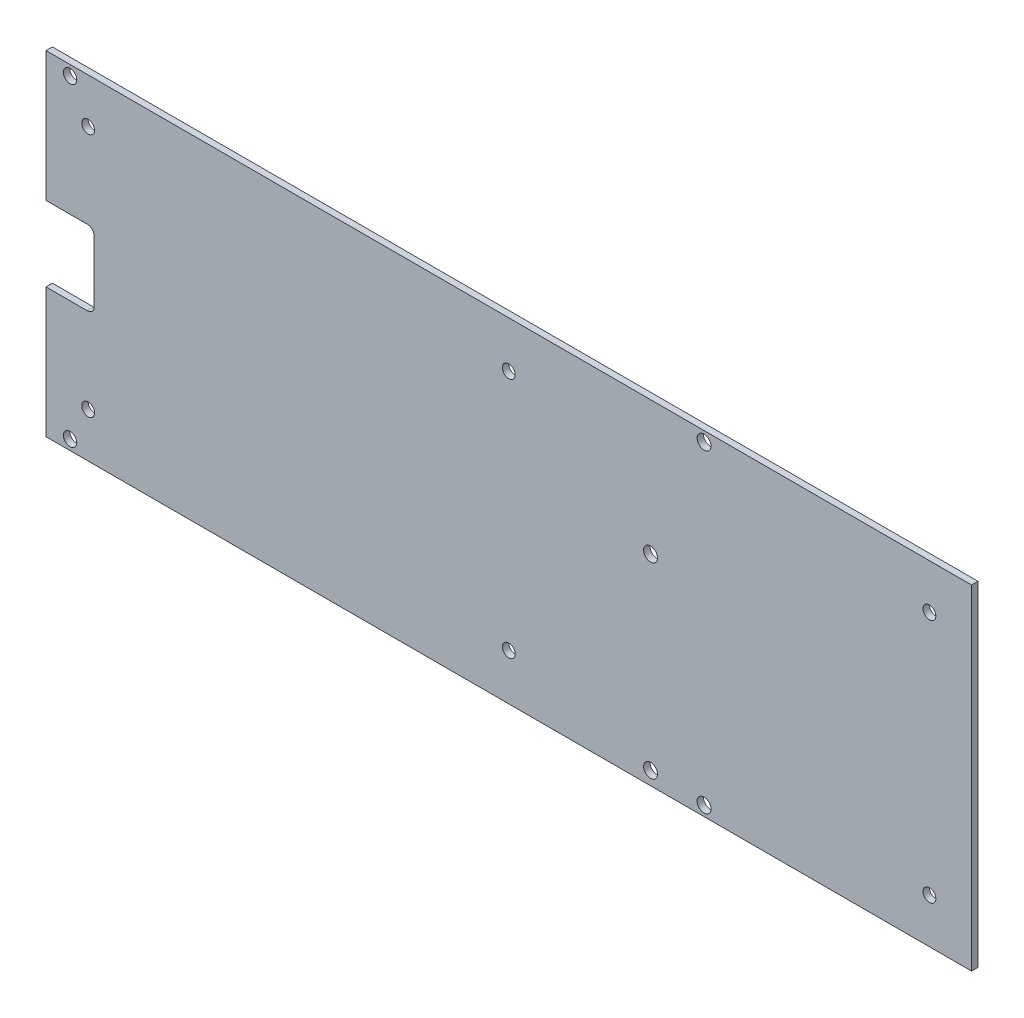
from build123d import *

# Parameters (mm, degrees)
SKETCH1_W        = 219.71
SKETCH1_H        = 79.375
EXTRUDE1_DEPTH   = 1.524
SKETCH2_R        = 1.524
SKETCH2_R_2      = 1.651
SKETCH2_R_3      = 1.5875
THRU_HOLES_DEPTH = 234.613350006
NOTCH_DEPTH      = 2.54


with BuildPart() as part:
    # Sketch1 → Extrude1 (new body)
    with BuildSketch(Plane.XY):
        with Locations((109.855, 39.6875)):
            Rectangle(SKETCH1_W, SKETCH1_H)
    extrude(amount=EXTRUDE1_DEPTH)

    # Sketch2 → thru_holes (cut, through all)
    with BuildSketch(Plane.XY.offset(1.524)):
        with Locations((209.7024, 68.7451)):
            Circle(SKETCH2_R)
        with Locations((109.855, 68.3895)):
            Circle(SKETCH2_R)
        with Locations((109.855, 10.9855)):
            Circle(SKETCH2_R)
        with Locations((209.7024, 10.6299)):
            Circle(SKETCH2_R)
        with Locations((10.0076, 10.6299)):
            Circle(SKETCH2_R)
        with Locations((10.0076, 68.7451)):
            Circle(SKETCH2_R)
        with Locations((156.21, 76.99375)):
            Circle(SKETCH2_R_2)
        with Locations((156.21, 2.38125)):
            Circle(SKETCH2_R_2)
        with Locations((5.715, 76.99375)):
            Circle(SKETCH2_R_3)
        with Locations((5.715, 2.38125)):
            Circle(SKETCH2_R_3)
        with Locations((143.51, 47.625)):
            Circle(SKETCH2_R_2)
        with Locations((143.51, 3.175)):
            Circle(SKETCH2_R_2)
    extrude(amount=-THRU_HOLES_DEPTH, mode=Mode.SUBTRACT)

    # Sketch4 → notch (cut)
    with BuildSketch(Plane.XY.offset(1.524)):
        with BuildLine():
            Line((0, 30.7975), (0, 48.5775))
            Line((0, 48.5775), (9.8425, 48.5775))
            ThreePointArc((9.8425, 48.5775), (10.965032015, 48.112532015), (11.43, 46.99))
            Line((11.43, 46.99), (11.43, 32.385))
            ThreePointArc((11.43, 32.385), (10.965032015, 31.262467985), (9.8425, 30.7975))
            Line((9.8425, 30.7975), (0, 30.7975))
        make_face()
    extrude(amount=-NOTCH_DEPTH, mode=Mode.SUBTRACT)


solid = part.part
